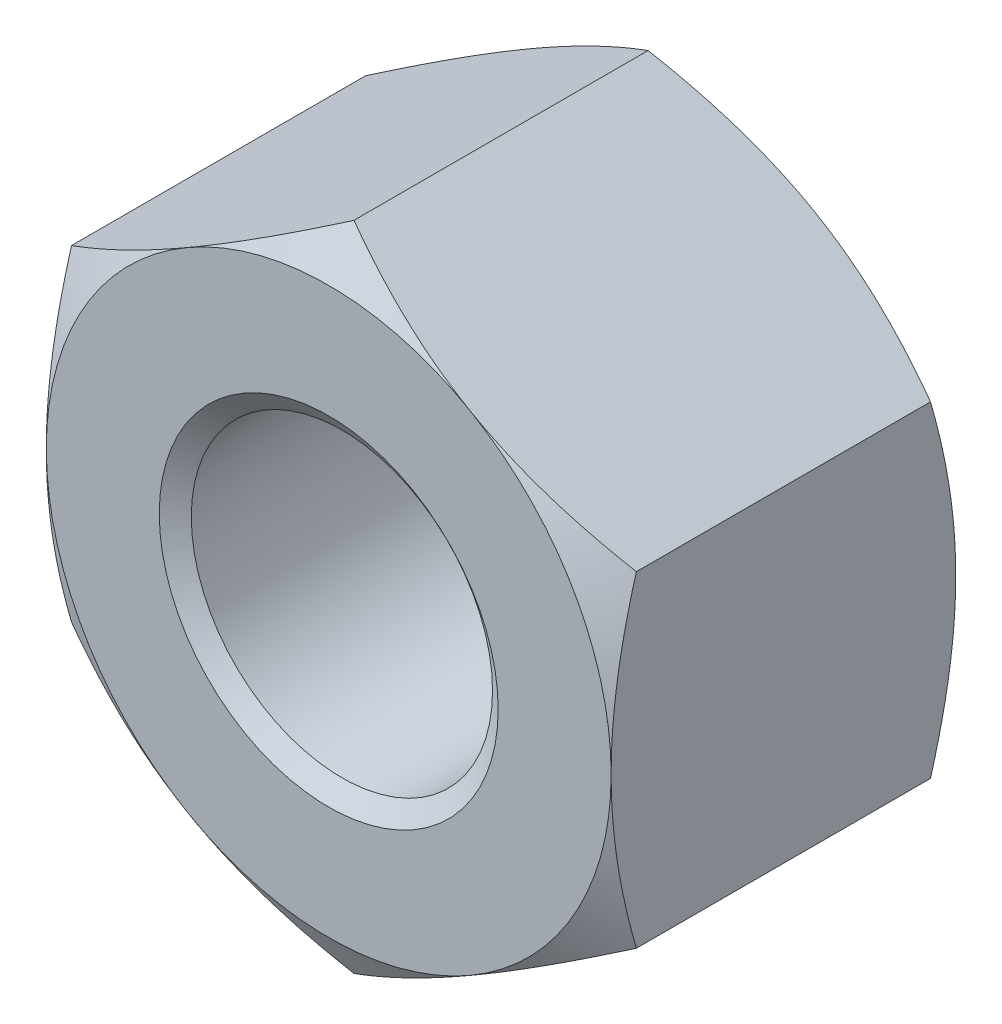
ISO-10303-21;
HEADER;
FILE_DESCRIPTION(('STEP AP214'),'2;1');
FILE_NAME('part.step','',(''),(''),'','','');
FILE_SCHEMA(('AUTOMOTIVE_DESIGN { 1 0 10303 214 1 1 1 1 }'));
ENDSEC;
DATA;
#1=APPLICATION_CONTEXT('core data for automotive mechanical design processes');
#2=APPLICATION_PROTOCOL_DEFINITION('international standard','automotive_design',2000,#1);
#3=PRODUCT_CONTEXT('',#1,'mechanical');
#4=PRODUCT('Part','Part','',(#3));
#5=PRODUCT_RELATED_PRODUCT_CATEGORY('part','',(#4));
#6=PRODUCT_DEFINITION_FORMATION('','',#4);
#7=PRODUCT_DEFINITION_CONTEXT('part definition',#1,'design');
#8=PRODUCT_DEFINITION('design','',#6,#7);
#9=PRODUCT_DEFINITION_SHAPE('','',#8);
#10=(LENGTH_UNIT() NAMED_UNIT(*) SI_UNIT(.MILLI.,.METRE.));
#11=(NAMED_UNIT(*) PLANE_ANGLE_UNIT() SI_UNIT($,.RADIAN.));
#12=(NAMED_UNIT(*) SI_UNIT($,.STERADIAN.) SOLID_ANGLE_UNIT());
#13=UNCERTAINTY_MEASURE_WITH_UNIT(LENGTH_MEASURE(1.E-05),#10,'distance_accuracy_value','');
#14=(GEOMETRIC_REPRESENTATION_CONTEXT(3) GLOBAL_UNCERTAINTY_ASSIGNED_CONTEXT((#13)) GLOBAL_UNIT_ASSIGNED_CONTEXT((#10,
#11,#12)) REPRESENTATION_CONTEXT('',''));
#15=CARTESIAN_POINT('',(0.,0.,0.));
#16=DIRECTION('',(0.,0.,1.));
#17=DIRECTION('',(1.,0.,0.));
#18=AXIS2_PLACEMENT_3D('',#15,#16,#17);
#19=CARTESIAN_POINT('',(0.,0.,-36.6));
#20=DIRECTION('',(0.,0.,1.));
#21=DIRECTION('',(1.,0.,0.));
#22=AXIS2_PLACEMENT_3D('',#19,#20,#21);
#23=CYLINDRICAL_SURFACE('',#22,16.);
#24=CARTESIAN_POINT('',(0.,0.,-1.40041507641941));
#25=DIRECTION('',(0.,0.,1.));
#26=DIRECTION('',(1.,0.,0.));
#27=AXIS2_PLACEMENT_3D('',#24,#25,#26);
#28=CIRCLE('',#27,16.);
#29=CARTESIAN_POINT('',(16.,0.,-1.40041507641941));
#30=VERTEX_POINT('',#29);
#31=EDGE_CURVE('E176',#30,#30,#28,.F.);
#32=ORIENTED_EDGE('',*,*,#31,.F.);
#33=EDGE_LOOP('',(#32));
#34=FACE_BOUND('',#33,.T.);
#35=CARTESIAN_POINT('',(0.,0.,-35.1741849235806));
#36=DIRECTION('',(0.,0.,-1.));
#37=DIRECTION('',(-1.,0.,0.));
#38=AXIS2_PLACEMENT_3D('',#35,#36,#37);
#39=CIRCLE('',#38,16.);
#40=CARTESIAN_POINT('',(-16.,0.,-35.1741849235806));
#41=VERTEX_POINT('',#40);
#42=EDGE_CURVE('E40',#41,#41,#39,.F.);
#43=ORIENTED_EDGE('',*,*,#42,.F.);
#44=EDGE_LOOP('',(#43));
#45=FACE_BOUND('',#44,.T.);
#46=ADVANCED_FACE('F35',(#34,#45),#23,.F.);
#47=CARTESIAN_POINT('',(0.,34.6410161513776,-36.6));
#48=DIRECTION('',(-0.500000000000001,0.866025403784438,0.));
#49=DIRECTION('',(-0.866025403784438,-0.500000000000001,0.));
#50=AXIS2_PLACEMENT_3D('',#47,#48,#49);
#51=PLANE('',#50);
#52=DIRECTION('',(0.,0.,1.));
#53=VECTOR('',#52,1.);
#54=CARTESIAN_POINT('',(-30.,17.3205080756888,-36.6));
#55=LINE('',#54,#53);
#56=CARTESIAN_POINT('',(-30.,17.3205080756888,-33.9205080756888));
#57=VERTEX_POINT('',#56);
#58=CARTESIAN_POINT('',(-30.,17.3205080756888,-2.67949192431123));
#59=VERTEX_POINT('',#58);
#60=EDGE_CURVE('E166',#57,#59,#55,.T.);
#61=ORIENTED_EDGE('',*,*,#60,.T.);
#62=CARTESIAN_POINT('',(-30.0002,17.3203926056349,-2.67955859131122));
#63=CARTESIAN_POINT('',(-29.3408134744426,17.7010895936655,-2.45977966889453));
#64=CARTESIAN_POINT('',(-28.6788549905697,18.0832715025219,-2.24997409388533));
#65=CARTESIAN_POINT('',(-27.349629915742,18.8506999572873,-1.85308185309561));
#66=CARTESIAN_POINT('',(-26.6823616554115,19.2359474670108,-1.66600265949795));
#67=CARTESIAN_POINT('',(-25.3412132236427,20.0102598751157,-1.31707423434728));
#68=CARTESIAN_POINT('',(-24.6673212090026,20.3993316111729,-1.15528525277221));
#69=CARTESIAN_POINT('',(-23.3148832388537,21.1801620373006,-0.860422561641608));
#70=CARTESIAN_POINT('',(-22.6363377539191,21.571920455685,-0.727345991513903));
#71=CARTESIAN_POINT('',(-21.2919369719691,22.3481106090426,-0.495557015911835));
#72=CARTESIAN_POINT('',(-20.6261813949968,22.7324847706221,-0.39607808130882));
#73=CARTESIAN_POINT('',(-19.2916197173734,23.5029943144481,-0.229274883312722));
#74=CARTESIAN_POINT('',(-18.6228135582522,23.8891297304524,-0.161951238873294));
#75=CARTESIAN_POINT('',(-17.2840778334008,24.6620491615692,-0.0611584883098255));
#76=CARTESIAN_POINT('',(-16.614150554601,25.0488318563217,-0.0276491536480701));
#77=CARTESIAN_POINT('',(-15.2736776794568,25.8227542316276,0.0047942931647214));
#78=CARTESIAN_POINT('',(-14.6031321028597,26.2098939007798,0.00372947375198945));
#79=CARTESIAN_POINT('',(-13.3495404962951,26.9336553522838,-0.0305600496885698));
#80=CARTESIAN_POINT('',(-12.766405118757,27.2703287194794,-0.0596034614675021));
#81=CARTESIAN_POINT('',(-11.6015250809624,27.9428725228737,-0.143287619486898));
#82=CARTESIAN_POINT('',(-11.0197804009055,28.2787429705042,-0.197927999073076));
#83=CARTESIAN_POINT('',(-9.85790357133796,28.9495528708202,-0.331855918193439));
#84=CARTESIAN_POINT('',(-9.27777336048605,29.2844912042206,-0.41116574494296));
#85=CARTESIAN_POINT('',(-8.12027041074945,29.9527758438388,-0.593040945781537));
#86=CARTESIAN_POINT('',(-7.54289766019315,30.2861221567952,-0.695606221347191));
#87=CARTESIAN_POINT('',(-6.37865168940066,30.9582998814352,-0.924874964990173));
#88=CARTESIAN_POINT('',(-5.79185010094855,31.2970899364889,-1.05206130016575));
#89=CARTESIAN_POINT('',(-4.6218384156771,31.9725964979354,-1.32717885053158));
#90=CARTESIAN_POINT('',(-4.03862881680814,32.3093127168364,-1.47511287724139));
#91=CARTESIAN_POINT('',(-2.87716867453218,32.9798820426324,-1.78948711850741));
#92=CARTESIAN_POINT('',(-2.29891074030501,33.3137394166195,-1.95589111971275));
#93=CARTESIAN_POINT('',(-1.14639443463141,33.9791450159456,-2.30554519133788));
#94=CARTESIAN_POINT('',(-0.572134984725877,34.3106938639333,-2.48879051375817));
#95=CARTESIAN_POINT('',(0.00020000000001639,34.6411316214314,-2.67955859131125));
#96=B_SPLINE_CURVE_WITH_KNOTS('',3,(#62,#63,#64,#65,#66,#67,#68,#69,#70,#71,#72,#73,#74,#75,#76,
#77,#78,#79,#80,#81,#82,#83,#84,#85,#86,#87,#88,#89,#90,#91,#92,#93,#94,#95),.UNSPECIFIED.,.F.,
.F.,(4,2,2,2,2,2,2,2,2,2,2,2,2,2,2,2,4),(0.,2.37750032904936,4.75578025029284,7.13964242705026,
9.52326699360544,11.8481083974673,14.172994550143,16.4951115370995,18.8171567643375,
20.8385880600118,22.8599904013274,24.8832242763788,26.9064495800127,28.9743372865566,
31.042505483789,33.1066880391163,35.1702904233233),.UNSPECIFIED.);
#97=CARTESIAN_POINT('',(-15.,25.9807621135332,0.));
#98=VERTEX_POINT('',#97);
#99=EDGE_CURVE('E62',#59,#98,#96,.T.);
#100=ORIENTED_EDGE('',*,*,#99,.T.);
#101=CARTESIAN_POINT('',(0.,34.6410161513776,-2.67949192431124));
#102=VERTEX_POINT('',#101);
#103=EDGE_CURVE('E245',#98,#102,#96,.T.);
#104=ORIENTED_EDGE('',*,*,#103,.T.);
#105=DIRECTION('',(0.,0.,1.));
#106=VECTOR('',#105,1.);
#107=CARTESIAN_POINT('',(0.,34.6410161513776,-36.6));
#108=LINE('',#107,#106);
#109=CARTESIAN_POINT('',(0.,34.6410161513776,-33.9205080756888));
#110=VERTEX_POINT('',#109);
#111=EDGE_CURVE('E151',#110,#102,#108,.T.);
#112=ORIENTED_EDGE('',*,*,#111,.F.);
#113=CARTESIAN_POINT('',(-30.0002,17.3203926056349,-33.9204414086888));
#114=CARTESIAN_POINT('',(-29.3408134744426,17.7010895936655,-34.1402203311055));
#115=CARTESIAN_POINT('',(-28.6788549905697,18.0832715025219,-34.3500259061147));
#116=CARTESIAN_POINT('',(-27.349629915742,18.8506999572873,-34.7469181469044));
#117=CARTESIAN_POINT('',(-26.6823616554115,19.2359474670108,-34.9339973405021));
#118=CARTESIAN_POINT('',(-25.3412132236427,20.0102598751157,-35.2829257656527));
#119=CARTESIAN_POINT('',(-24.6673212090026,20.3993316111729,-35.4447147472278));
#120=CARTESIAN_POINT('',(-23.3148832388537,21.1801620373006,-35.7395774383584));
#121=CARTESIAN_POINT('',(-22.6363377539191,21.571920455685,-35.8726540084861));
#122=CARTESIAN_POINT('',(-21.2919369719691,22.3481106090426,-36.1044429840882));
#123=CARTESIAN_POINT('',(-20.6261813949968,22.7324847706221,-36.2039219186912));
#124=CARTESIAN_POINT('',(-19.2916197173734,23.5029943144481,-36.3707251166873));
#125=CARTESIAN_POINT('',(-18.6228135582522,23.8891297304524,-36.4380487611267));
#126=CARTESIAN_POINT('',(-17.2840778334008,24.6620491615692,-36.5388415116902));
#127=CARTESIAN_POINT('',(-16.614150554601,25.0488318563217,-36.5723508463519));
#128=CARTESIAN_POINT('',(-15.2736776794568,25.8227542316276,-36.6047942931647));
#129=CARTESIAN_POINT('',(-14.6031321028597,26.2098939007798,-36.603729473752));
#130=CARTESIAN_POINT('',(-13.3495404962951,26.9336553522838,-36.5694399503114));
#131=CARTESIAN_POINT('',(-12.766405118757,27.2703287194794,-36.5403965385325));
#132=CARTESIAN_POINT('',(-11.6015250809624,27.9428725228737,-36.4567123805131));
#133=CARTESIAN_POINT('',(-11.0197804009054,28.2787429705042,-36.4020720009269));
#134=CARTESIAN_POINT('',(-9.85790357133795,28.9495528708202,-36.2681440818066));
#135=CARTESIAN_POINT('',(-9.27777336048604,29.2844912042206,-36.188834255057));
#136=CARTESIAN_POINT('',(-8.12027041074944,29.9527758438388,-36.0069590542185));
#137=CARTESIAN_POINT('',(-7.54289766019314,30.2861221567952,-35.9043937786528));
#138=CARTESIAN_POINT('',(-6.37865168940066,30.9582998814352,-35.6751250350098));
#139=CARTESIAN_POINT('',(-5.79185010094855,31.2970899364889,-35.5479386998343));
#140=CARTESIAN_POINT('',(-4.6218384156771,31.9725964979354,-35.2728211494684));
#141=CARTESIAN_POINT('',(-4.03862881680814,32.3093127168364,-35.1248871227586));
#142=CARTESIAN_POINT('',(-2.87716867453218,32.9798820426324,-34.8105128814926));
#143=CARTESIAN_POINT('',(-2.29891074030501,33.3137394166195,-34.6441088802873));
#144=CARTESIAN_POINT('',(-1.14639443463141,33.9791450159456,-34.2944548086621));
#145=CARTESIAN_POINT('',(-0.572134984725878,34.3106938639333,-34.1112094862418));
#146=CARTESIAN_POINT('',(0.000200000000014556,34.6411316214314,-33.9204414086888));
#147=B_SPLINE_CURVE_WITH_KNOTS('',3,(#113,#114,#115,#116,#117,#118,#119,#120,#121,#122,#123,
#124,#125,#126,#127,#128,#129,#130,#131,#132,#133,#134,#135,#136,#137,#138,#139,#140,#141,#142,
#143,#144,#145,#146),.UNSPECIFIED.,.F.,.F.,(4,2,2,2,2,2,2,2,2,2,2,2,2,2,2,2,4),(0.,
2.37750032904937,4.75578025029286,7.13964242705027,9.52326699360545,11.8481083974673,
14.172994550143,16.4951115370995,18.8171567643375,20.8385880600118,22.8599904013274,
24.8832242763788,26.9064495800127,28.9743372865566,31.042505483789,33.1066880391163,
35.1702904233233),.UNSPECIFIED.);
#148=CARTESIAN_POINT('',(-15.,25.9807621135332,-36.6));
#149=VERTEX_POINT('',#148);
#150=EDGE_CURVE('E169',#149,#110,#147,.T.);
#151=ORIENTED_EDGE('',*,*,#150,.F.);
#152=EDGE_CURVE('E268',#57,#149,#147,.T.);
#153=ORIENTED_EDGE('',*,*,#152,.F.);
#154=EDGE_LOOP('',(#61,#100,#104,#112,#151,#153));
#155=FACE_BOUND('',#154,.T.);
#156=ADVANCED_FACE('F37',(#155),#51,.T.);
#157=CARTESIAN_POINT('',(30.,17.3205080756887,-36.6));
#158=DIRECTION('',(0.500000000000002,0.866025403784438,0.));
#159=DIRECTION('',(-0.866025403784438,0.500000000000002,0.));
#160=AXIS2_PLACEMENT_3D('',#157,#158,#159);
#161=PLANE('',#160);
#162=ORIENTED_EDGE('',*,*,#111,.T.);
#163=CARTESIAN_POINT('',(-0.000199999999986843,34.6411316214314,-2.67955859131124));
#164=CARTESIAN_POINT('',(0.659186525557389,34.2604346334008,-2.45977966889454));
#165=CARTESIAN_POINT('',(1.32114500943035,33.8782527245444,-2.24997409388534));
#166=CARTESIAN_POINT('',(2.65037008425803,33.1108242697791,-1.85308185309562));
#167=CARTESIAN_POINT('',(3.3176383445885,32.7255767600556,-1.66600265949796));
#168=CARTESIAN_POINT('',(4.65878677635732,31.9512643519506,-1.31707423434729));
#169=CARTESIAN_POINT('',(5.33267879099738,31.5621926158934,-1.15528525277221));
#170=CARTESIAN_POINT('',(6.68511676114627,30.7813621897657,-0.860422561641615));
#171=CARTESIAN_POINT('',(7.36366224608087,30.3896037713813,-0.727345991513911));
#172=CARTESIAN_POINT('',(8.70806302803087,29.6134136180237,-0.495557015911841));
#173=CARTESIAN_POINT('',(9.37381860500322,29.2290394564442,-0.396078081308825));
#174=CARTESIAN_POINT('',(10.7083802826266,28.4585299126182,-0.229274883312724));
#175=CARTESIAN_POINT('',(11.3771864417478,28.0723944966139,-0.161951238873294));
#176=CARTESIAN_POINT('',(12.7159221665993,27.2994750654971,-0.0611584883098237));
#177=CARTESIAN_POINT('',(13.385849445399,26.9126923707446,-0.0276491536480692));
#178=CARTESIAN_POINT('',(14.7263223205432,26.1387699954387,0.00479429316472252));
#179=CARTESIAN_POINT('',(15.3968678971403,25.7516303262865,0.0037294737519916));
#180=CARTESIAN_POINT('',(16.6504595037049,25.0278688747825,-0.030560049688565));
#181=CARTESIAN_POINT('',(17.233594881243,24.6911955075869,-0.0596034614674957));
#182=CARTESIAN_POINT('',(18.3984749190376,24.0186517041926,-0.14328761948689));
#183=CARTESIAN_POINT('',(18.9802195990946,23.6827812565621,-0.197927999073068));
#184=CARTESIAN_POINT('',(20.1420964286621,23.0119713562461,-0.33185591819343));
#185=CARTESIAN_POINT('',(20.722226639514,22.6770330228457,-0.411165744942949));
#186=CARTESIAN_POINT('',(21.8797295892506,22.0087483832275,-0.593040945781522));
#187=CARTESIAN_POINT('',(22.4571023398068,21.6754020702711,-0.695606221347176));
#188=CARTESIAN_POINT('',(23.6213483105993,21.0032243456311,-0.924874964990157));
#189=CARTESIAN_POINT('',(24.2081498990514,20.6644342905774,-1.05206130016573));
#190=CARTESIAN_POINT('',(25.3781615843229,19.9889277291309,-1.32717885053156));
#191=CARTESIAN_POINT('',(25.9613711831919,19.6522115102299,-1.47511287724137));
#192=CARTESIAN_POINT('',(27.1228313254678,18.9816421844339,-1.78948711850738));
#193=CARTESIAN_POINT('',(27.701089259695,18.6477848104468,-1.95589111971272));
#194=CARTESIAN_POINT('',(28.8536055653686,17.9823792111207,-2.30554519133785));
#195=CARTESIAN_POINT('',(29.4278650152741,17.650830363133,-2.48879051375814));
#196=CARTESIAN_POINT('',(30.0002,17.3203926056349,-2.67955859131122));
#197=B_SPLINE_CURVE_WITH_KNOTS('',3,(#163,#164,#165,#166,#167,#168,#169,#170,#171,#172,#173,
#174,#175,#176,#177,#178,#179,#180,#181,#182,#183,#184,#185,#186,#187,#188,#189,#190,#191,#192,
#193,#194,#195,#196),.UNSPECIFIED.,.F.,.F.,(4,2,2,2,2,2,2,2,2,2,2,2,2,2,2,2,4),(0.,
2.37750032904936,4.75578025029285,7.13964242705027,9.52326699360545,11.8481083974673,
14.172994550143,16.4951115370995,18.8171567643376,20.8385880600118,22.8599904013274,
24.8832242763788,26.9064495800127,28.9743372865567,31.042505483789,33.1066880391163,
35.1702904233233),.UNSPECIFIED.);
#198=CARTESIAN_POINT('',(15.,25.9807621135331,0.));
#199=VERTEX_POINT('',#198);
#200=EDGE_CURVE('E144',#102,#199,#197,.T.);
#201=ORIENTED_EDGE('',*,*,#200,.T.);
#202=CARTESIAN_POINT('',(30.,17.3205080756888,-2.67949192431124));
#203=VERTEX_POINT('',#202);
#204=EDGE_CURVE('E130',#199,#203,#197,.T.);
#205=ORIENTED_EDGE('',*,*,#204,.T.);
#206=DIRECTION('',(0.,0.,1.));
#207=VECTOR('',#206,1.);
#208=CARTESIAN_POINT('',(30.,17.3205080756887,-36.6));
#209=LINE('',#208,#207);
#210=CARTESIAN_POINT('',(30.,17.3205080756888,-33.9205080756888));
#211=VERTEX_POINT('',#210);
#212=EDGE_CURVE('E143',#211,#203,#209,.T.);
#213=ORIENTED_EDGE('',*,*,#212,.F.);
#214=CARTESIAN_POINT('',(-0.000199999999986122,34.6411316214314,-33.9204414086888));
#215=CARTESIAN_POINT('',(0.659186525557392,34.2604346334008,-34.1402203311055));
#216=CARTESIAN_POINT('',(1.32114500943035,33.8782527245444,-34.3500259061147));
#217=CARTESIAN_POINT('',(2.65037008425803,33.1108242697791,-34.7469181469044));
#218=CARTESIAN_POINT('',(3.31763834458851,32.7255767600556,-34.933997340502));
#219=CARTESIAN_POINT('',(4.65878677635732,31.9512643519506,-35.2829257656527));
#220=CARTESIAN_POINT('',(5.33267879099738,31.5621926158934,-35.4447147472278));
#221=CARTESIAN_POINT('',(6.68511676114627,30.7813621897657,-35.7395774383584));
#222=CARTESIAN_POINT('',(7.36366224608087,30.3896037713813,-35.8726540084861));
#223=CARTESIAN_POINT('',(8.70806302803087,29.6134136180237,-36.1044429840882));
#224=CARTESIAN_POINT('',(9.37381860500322,29.2290394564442,-36.2039219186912));
#225=CARTESIAN_POINT('',(10.7083802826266,28.4585299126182,-36.3707251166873));
#226=CARTESIAN_POINT('',(11.3771864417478,28.0723944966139,-36.4380487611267));
#227=CARTESIAN_POINT('',(12.7159221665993,27.2994750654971,-36.5388415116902));
#228=CARTESIAN_POINT('',(13.385849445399,26.9126923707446,-36.5723508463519));
#229=CARTESIAN_POINT('',(14.7263223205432,26.1387699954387,-36.6047942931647));
#230=CARTESIAN_POINT('',(15.3968678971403,25.7516303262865,-36.603729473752));
#231=CARTESIAN_POINT('',(16.6504595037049,25.0278688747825,-36.5694399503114));
#232=CARTESIAN_POINT('',(17.233594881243,24.6911955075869,-36.5403965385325));
#233=CARTESIAN_POINT('',(18.3984749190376,24.0186517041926,-36.4567123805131));
#234=CARTESIAN_POINT('',(18.9802195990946,23.6827812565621,-36.4020720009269));
#235=CARTESIAN_POINT('',(20.142096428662,23.0119713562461,-36.2681440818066));
#236=CARTESIAN_POINT('',(20.722226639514,22.6770330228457,-36.188834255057));
#237=CARTESIAN_POINT('',(21.8797295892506,22.0087483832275,-36.0069590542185));
#238=CARTESIAN_POINT('',(22.4571023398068,21.6754020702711,-35.9043937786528));
#239=CARTESIAN_POINT('',(23.6213483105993,21.0032243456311,-35.6751250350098));
#240=CARTESIAN_POINT('',(24.2081498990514,20.6644342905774,-35.5479386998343));
#241=CARTESIAN_POINT('',(25.3781615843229,19.9889277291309,-35.2728211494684));
#242=CARTESIAN_POINT('',(25.9613711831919,19.6522115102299,-35.1248871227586));
#243=CARTESIAN_POINT('',(27.1228313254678,18.9816421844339,-34.8105128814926));
#244=CARTESIAN_POINT('',(27.701089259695,18.6477848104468,-34.6441088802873));
#245=CARTESIAN_POINT('',(28.8536055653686,17.9823792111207,-34.2944548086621));
#246=CARTESIAN_POINT('',(29.4278650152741,17.650830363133,-34.1112094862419));
#247=CARTESIAN_POINT('',(30.0002,17.3203926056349,-33.9204414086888));
#248=B_SPLINE_CURVE_WITH_KNOTS('',3,(#214,#215,#216,#217,#218,#219,#220,#221,#222,#223,#224,
#225,#226,#227,#228,#229,#230,#231,#232,#233,#234,#235,#236,#237,#238,#239,#240,#241,#242,#243,
#244,#245,#246,#247),.UNSPECIFIED.,.F.,.F.,(4,2,2,2,2,2,2,2,2,2,2,2,2,2,2,2,4),(0.,
2.37750032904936,4.75578025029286,7.13964242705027,9.52326699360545,11.8481083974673,
14.172994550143,16.4951115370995,18.8171567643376,20.8385880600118,22.8599904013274,
24.8832242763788,26.9064495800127,28.9743372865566,31.042505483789,33.1066880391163,
35.1702904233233),.UNSPECIFIED.);
#249=CARTESIAN_POINT('',(15.,25.9807621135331,-36.6));
#250=VERTEX_POINT('',#249);
#251=EDGE_CURVE('E261',#250,#211,#248,.T.);
#252=ORIENTED_EDGE('',*,*,#251,.F.);
#253=EDGE_CURVE('E267',#110,#250,#248,.T.);
#254=ORIENTED_EDGE('',*,*,#253,.F.);
#255=EDGE_LOOP('',(#162,#201,#205,#213,#252,#254));
#256=FACE_BOUND('',#255,.T.);
#257=ADVANCED_FACE('F141',(#256),#161,.T.);
#258=CARTESIAN_POINT('',(30.,17.3205080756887,-36.6));
#259=DIRECTION('',(-1.,0.,0.));
#260=DIRECTION('',(0.,0.,1.));
#261=AXIS2_PLACEMENT_3D('',#258,#259,#260);
#262=PLANE('',#261);
#263=CARTESIAN_POINT('',(30.,-45.9365399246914,-14.3558011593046));
#264=CARTESIAN_POINT('',(30.,-45.2779799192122,-14.0374660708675));
#265=CARTESIAN_POINT('',(30.,-44.618623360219,-13.7207736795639));
#266=CARTESIAN_POINT('',(30.,-43.2981500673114,-13.0910621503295));
#267=CARTESIAN_POINT('',(30.,-42.6370333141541,-12.77804305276));
#268=CARTESIAN_POINT('',(30.,-41.3127746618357,-12.156020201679));
#269=CARTESIAN_POINT('',(30.,-40.6496324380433,-11.8470171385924));
#270=CARTESIAN_POINT('',(30.,-39.3212556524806,-11.2335482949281));
#271=CARTESIAN_POINT('',(30.,-38.6560210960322,-10.9290825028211));
#272=CARTESIAN_POINT('',(30.,-36.6492550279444,-10.0197947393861));
#273=CARTESIAN_POINT('',(30.,-35.3042292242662,-9.42265106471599));
#274=CARTESIAN_POINT('',(30.,-32.6031179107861,-8.25397733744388));
#275=CARTESIAN_POINT('',(30.,-31.2470329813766,-7.68244595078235));
#276=CARTESIAN_POINT('',(30.,-29.1945715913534,-6.84617094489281));
#277=CARTESIAN_POINT('',(30.,-28.5031277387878,-6.56930860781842));
#278=CARTESIAN_POINT('',(30.,-27.1165240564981,-6.02506333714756));
#279=CARTESIAN_POINT('',(30.,-26.4213642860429,-5.75768025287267));
#280=CARTESIAN_POINT('',(30.,-25.0269061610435,-5.23361865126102));
#281=CARTESIAN_POINT('',(30.,-24.327607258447,-4.97694158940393));
#282=CARTESIAN_POINT('',(30.,-22.9246473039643,-4.47578921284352));
#283=CARTESIAN_POINT('',(30.,-22.2209862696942,-4.23131384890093));
#284=CARTESIAN_POINT('',(30.,-20.8104996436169,-3.75672417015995));
#285=CARTESIAN_POINT('',(30.,-20.1036841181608,-3.52658008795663));
#286=CARTESIAN_POINT('',(30.,-18.6851603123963,-3.08194699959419));
#287=CARTESIAN_POINT('',(30.,-17.9734519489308,-2.86745826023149));
#288=CARTESIAN_POINT('',(30.,-15.8309943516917,-2.25062130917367));
#289=CARTESIAN_POINT('',(30.,-14.3923690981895,-1.87471629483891));
#290=CARTESIAN_POINT('',(30.,-12.2190084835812,-1.37763749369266));
#291=CARTESIAN_POINT('',(30.,-11.4918302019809,-1.22304890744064));
#292=CARTESIAN_POINT('',(30.,-10.032627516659,-0.938571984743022));
#293=CARTESIAN_POINT('',(30.,-9.30060322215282,-0.808683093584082));
#294=CARTESIAN_POINT('',(30.,-7.83220784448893,-0.575908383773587));
#295=CARTESIAN_POINT('',(30.,-7.09583649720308,-0.47302422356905));
#296=CARTESIAN_POINT('',(30.,-5.61958846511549,-0.296325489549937));
#297=CARTESIAN_POINT('',(30.,-4.87971177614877,-0.222510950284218));
#298=CARTESIAN_POINT('',(30.,-3.40223019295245,-0.105938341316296));
#299=CARTESIAN_POINT('',(30.,-2.66464072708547,-0.0629859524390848));
#300=CARTESIAN_POINT('',(30.,-1.18830595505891,-0.00836455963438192));
#301=CARTESIAN_POINT('',(30.,-0.449560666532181,0.00330491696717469));
#302=CARTESIAN_POINT('',(30.,1.02754564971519,-0.0049121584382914));
#303=CARTESIAN_POINT('',(30.,1.76590672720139,-0.0247899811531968));
#304=CARTESIAN_POINT('',(30.,3.24116955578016,-0.0956227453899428));
#305=CARTESIAN_POINT('',(30.,3.97807124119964,-0.14657905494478));
#306=CARTESIAN_POINT('',(30.,5.23855697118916,-0.259530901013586));
#307=CARTESIAN_POINT('',(30.,5.76281317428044,-0.314189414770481));
#308=CARTESIAN_POINT('',(30.,6.8095998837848,-0.438134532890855));
#309=CARTESIAN_POINT('',(30.,7.33213033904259,-0.50742156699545));
#310=CARTESIAN_POINT('',(30.,8.89675150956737,-0.736205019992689));
#311=CARTESIAN_POINT('',(30.,9.93583394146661,-0.916620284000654));
#312=CARTESIAN_POINT('',(30.,12.0063032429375,-1.32712724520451));
#313=CARTESIAN_POINT('',(30.,13.0376686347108,-1.55732543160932));
#314=CARTESIAN_POINT('',(30.,15.0898614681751,-2.06024329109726));
#315=CARTESIAN_POINT('',(30.,16.1106893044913,-2.33296136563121));
#316=CARTESIAN_POINT('',(30.,18.1658167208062,-2.92121193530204));
#317=CARTESIAN_POINT('',(30.,19.1998696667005,-3.2375994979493));
#318=CARTESIAN_POINT('',(30.,21.2578611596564,-3.9018741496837));
#319=CARTESIAN_POINT('',(30.,22.2817987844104,-4.24976408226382));
#320=CARTESIAN_POINT('',(30.,23.8078178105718,-4.79021589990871));
#321=CARTESIAN_POINT('',(30.,24.3134225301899,-4.97292492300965));
#322=CARTESIAN_POINT('',(30.,25.3224597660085,-5.34426474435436));
#323=CARTESIAN_POINT('',(30.,25.8258922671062,-5.53289558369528));
#324=CARTESIAN_POINT('',(30.,26.8305266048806,-5.9154885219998));
#325=CARTESIAN_POINT('',(30.,27.3317291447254,-6.10944877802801));
#326=CARTESIAN_POINT('',(30.,28.3321829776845,-6.50229905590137));
#327=CARTESIAN_POINT('',(30.,28.8314343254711,-6.70118893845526));
#328=CARTESIAN_POINT('',(30.,29.3297774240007,-6.9023175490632));
#329=B_SPLINE_CURVE_WITH_KNOTS('',3,(#263,#264,#265,#266,#267,#268,#269,#270,#271,#272,#273,
#274,#275,#276,#277,#278,#279,#280,#281,#282,#283,#284,#285,#286,#287,#288,#289,#290,#291,#292,
#293,#294,#295,#296,#297,#298,#299,#300,#301,#302,#303,#304,#305,#306,#307,#308,#309,#310,#311,
#312,#313,#314,#315,#316,#317,#318,#319,#320,#321,#322,#323,#324,#325,#326,#327,#328),
.UNSPECIFIED.,.F.,.F.,(4,2,2,2,2,2,2,2,2,2,2,2,2,2,2,2,2,2,2,2,2,2,2,2,2,2,2,2,2,2,2,2,4),(0.,
2.19439073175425,4.38880555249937,6.58359276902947,8.77837440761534,13.1930371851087,
17.6074697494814,19.841854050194,22.0762028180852,24.3108543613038,26.5454968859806,
28.7753313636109,31.0052038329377,35.463226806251,37.6931748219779,39.9230727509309,
42.1531075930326,44.3831450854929,46.5990153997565,48.8148522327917,51.0300760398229,
53.2453973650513,54.826487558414,56.4076242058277,59.5700120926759,62.7392326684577,
65.9083341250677,69.1518605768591,72.3956800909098,74.0084654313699,75.6212619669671,
77.2335076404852,78.8457078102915),.UNSPECIFIED.);
#330=CARTESIAN_POINT('',(30.,-17.3205080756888,-2.67949192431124));
#331=VERTEX_POINT('',#330);
#332=CARTESIAN_POINT('',(30.,0.,0.));
#333=VERTEX_POINT('',#332);
#334=EDGE_CURVE('E136',#331,#333,#329,.T.);
#335=ORIENTED_EDGE('',*,*,#334,.F.);
#336=DIRECTION('',(0.,0.,1.));
#337=VECTOR('',#336,1.);
#338=CARTESIAN_POINT('',(30.,-17.3205080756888,-36.6));
#339=LINE('',#338,#337);
#340=CARTESIAN_POINT('',(30.,-17.3205080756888,-33.9205080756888));
#341=VERTEX_POINT('',#340);
#342=EDGE_CURVE('E152',#341,#331,#339,.T.);
#343=ORIENTED_EDGE('',*,*,#342,.F.);
#344=CARTESIAN_POINT('',(30.,-45.9365399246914,-22.2441988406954));
#345=CARTESIAN_POINT('',(30.,-45.2779799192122,-22.5625339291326));
#346=CARTESIAN_POINT('',(30.,-44.618623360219,-22.8792263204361));
#347=CARTESIAN_POINT('',(30.,-43.2981500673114,-23.5089378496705));
#348=CARTESIAN_POINT('',(30.,-42.6370333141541,-23.82195694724));
#349=CARTESIAN_POINT('',(30.,-41.3127746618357,-24.443979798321));
#350=CARTESIAN_POINT('',(30.,-40.6496324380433,-24.7529828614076));
#351=CARTESIAN_POINT('',(30.,-39.3212556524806,-25.3664517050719));
#352=CARTESIAN_POINT('',(30.,-38.6560210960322,-25.6709174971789));
#353=CARTESIAN_POINT('',(30.,-36.6492550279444,-26.5802052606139));
#354=CARTESIAN_POINT('',(30.,-35.3042292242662,-27.177348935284));
#355=CARTESIAN_POINT('',(30.,-32.6031179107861,-28.3460226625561));
#356=CARTESIAN_POINT('',(30.,-31.2470329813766,-28.9175540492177));
#357=CARTESIAN_POINT('',(30.,-29.1945715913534,-29.7538290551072));
#358=CARTESIAN_POINT('',(30.,-28.5031277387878,-30.0306913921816));
#359=CARTESIAN_POINT('',(30.,-27.116524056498,-30.5749366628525));
#360=CARTESIAN_POINT('',(30.,-26.4213642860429,-30.8423197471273));
#361=CARTESIAN_POINT('',(30.,-25.0269061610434,-31.366381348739));
#362=CARTESIAN_POINT('',(30.,-24.327607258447,-31.6230584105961));
#363=CARTESIAN_POINT('',(30.,-22.9246473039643,-32.1242107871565));
#364=CARTESIAN_POINT('',(30.,-22.2209862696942,-32.3686861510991));
#365=CARTESIAN_POINT('',(30.,-20.8104996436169,-32.8432758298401));
#366=CARTESIAN_POINT('',(30.,-20.1036841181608,-33.0734199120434));
#367=CARTESIAN_POINT('',(30.,-18.6851603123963,-33.5180530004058));
#368=CARTESIAN_POINT('',(30.,-17.9734519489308,-33.7325417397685));
#369=CARTESIAN_POINT('',(30.,-15.8309943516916,-34.3493786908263));
#370=CARTESIAN_POINT('',(30.,-14.3923690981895,-34.7252837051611));
#371=CARTESIAN_POINT('',(30.,-12.2190084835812,-35.2223625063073));
#372=CARTESIAN_POINT('',(30.,-11.4918302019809,-35.3769510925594));
#373=CARTESIAN_POINT('',(30.,-10.032627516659,-35.661428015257));
#374=CARTESIAN_POINT('',(30.,-9.30060322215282,-35.7913169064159));
#375=CARTESIAN_POINT('',(30.,-7.83220784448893,-36.0240916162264));
#376=CARTESIAN_POINT('',(30.,-7.09583649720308,-36.1269757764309));
#377=CARTESIAN_POINT('',(30.,-5.6195884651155,-36.3036745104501));
#378=CARTESIAN_POINT('',(30.,-4.87971177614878,-36.3774890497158));
#379=CARTESIAN_POINT('',(30.,-3.40223019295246,-36.4940616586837));
#380=CARTESIAN_POINT('',(30.,-2.66464072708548,-36.5370140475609));
#381=CARTESIAN_POINT('',(30.,-1.18830595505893,-36.5916354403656));
#382=CARTESIAN_POINT('',(30.,-0.449560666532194,-36.6033049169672));
#383=CARTESIAN_POINT('',(30.,1.02754564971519,-36.5950878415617));
#384=CARTESIAN_POINT('',(30.,1.76590672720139,-36.5752100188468));
#385=CARTESIAN_POINT('',(30.,3.24116955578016,-36.5043772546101));
#386=CARTESIAN_POINT('',(30.,3.97807124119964,-36.4534209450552));
#387=CARTESIAN_POINT('',(30.,5.23855697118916,-36.3404690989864));
#388=CARTESIAN_POINT('',(30.,5.76281317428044,-36.2858105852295));
#389=CARTESIAN_POINT('',(30.,6.8095998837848,-36.1618654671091));
#390=CARTESIAN_POINT('',(30.,7.33213033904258,-36.0925784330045));
#391=CARTESIAN_POINT('',(30.,8.89675150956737,-35.8637949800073));
#392=CARTESIAN_POINT('',(30.,9.93583394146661,-35.6833797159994));
#393=CARTESIAN_POINT('',(30.,12.0063032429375,-35.2728727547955));
#394=CARTESIAN_POINT('',(30.,13.0376686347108,-35.0426745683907));
#395=CARTESIAN_POINT('',(30.,15.0898614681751,-34.5397567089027));
#396=CARTESIAN_POINT('',(30.,16.1106893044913,-34.2670386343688));
#397=CARTESIAN_POINT('',(30.,18.1658167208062,-33.678788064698));
#398=CARTESIAN_POINT('',(30.,19.1998696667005,-33.3624005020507));
#399=CARTESIAN_POINT('',(30.,21.2578611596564,-32.6981258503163));
#400=CARTESIAN_POINT('',(30.,22.2817987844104,-32.3502359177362));
#401=CARTESIAN_POINT('',(30.,23.8078178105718,-31.8097841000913));
#402=CARTESIAN_POINT('',(30.,24.3134225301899,-31.6270750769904));
#403=CARTESIAN_POINT('',(30.,25.3224597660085,-31.2557352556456));
#404=CARTESIAN_POINT('',(30.,25.8258922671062,-31.0671044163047));
#405=CARTESIAN_POINT('',(30.,26.8305266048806,-30.6845114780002));
#406=CARTESIAN_POINT('',(30.,27.3317291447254,-30.490551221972));
#407=CARTESIAN_POINT('',(30.,28.3321829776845,-30.0977009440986));
#408=CARTESIAN_POINT('',(30.,28.8314343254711,-29.8988110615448));
#409=CARTESIAN_POINT('',(30.,29.3297774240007,-29.6976824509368));
#410=B_SPLINE_CURVE_WITH_KNOTS('',3,(#344,#345,#346,#347,#348,#349,#350,#351,#352,#353,#354,
#355,#356,#357,#358,#359,#360,#361,#362,#363,#364,#365,#366,#367,#368,#369,#370,#371,#372,#373,
#374,#375,#376,#377,#378,#379,#380,#381,#382,#383,#384,#385,#386,#387,#388,#389,#390,#391,#392,
#393,#394,#395,#396,#397,#398,#399,#400,#401,#402,#403,#404,#405,#406,#407,#408,#409),
.UNSPECIFIED.,.F.,.F.,(4,2,2,2,2,2,2,2,2,2,2,2,2,2,2,2,2,2,2,2,2,2,2,2,2,2,2,2,2,2,2,2,4),(0.,
2.19439073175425,4.38880555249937,6.58359276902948,8.77837440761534,13.1930371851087,
17.6074697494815,19.8418540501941,22.0762028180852,24.3108543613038,26.5454968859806,
28.7753313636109,31.0052038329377,35.463226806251,37.6931748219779,39.9230727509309,
42.1531075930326,44.3831450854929,46.5990153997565,48.8148522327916,51.0300760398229,
53.2453973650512,54.826487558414,56.4076242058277,59.5700120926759,62.7392326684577,
65.9083341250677,69.1518605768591,72.3956800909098,74.0084654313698,75.621261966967,
77.2335076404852,78.8457078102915),.UNSPECIFIED.);
#411=CARTESIAN_POINT('',(30.,0.,-36.6));
#412=VERTEX_POINT('',#411);
#413=EDGE_CURVE('E274',#341,#412,#410,.T.);
#414=ORIENTED_EDGE('',*,*,#413,.T.);
#415=EDGE_CURVE('E150',#412,#211,#410,.T.);
#416=ORIENTED_EDGE('',*,*,#415,.T.);
#417=ORIENTED_EDGE('',*,*,#212,.T.);
#418=EDGE_CURVE('E127',#333,#203,#329,.T.);
#419=ORIENTED_EDGE('',*,*,#418,.F.);
#420=EDGE_LOOP('',(#335,#343,#414,#416,#417,#419));
#421=FACE_BOUND('',#420,.T.);
#422=ADVANCED_FACE('F147',(#421),#262,.F.);
#423=CARTESIAN_POINT('',(0.,-34.6410161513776,-36.6));
#424=DIRECTION('',(0.500000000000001,-0.866025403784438,0.));
#425=DIRECTION('',(0.866025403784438,0.500000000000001,0.));
#426=AXIS2_PLACEMENT_3D('',#423,#424,#425);
#427=PLANE('',#426);
#428=ORIENTED_EDGE('',*,*,#342,.T.);
#429=CARTESIAN_POINT('',(30.0002,-17.320392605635,-2.67955859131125));
#430=CARTESIAN_POINT('',(29.3408134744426,-17.7010895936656,-2.45977966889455));
#431=CARTESIAN_POINT('',(28.6788549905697,-18.083271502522,-2.24997409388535));
#432=CARTESIAN_POINT('',(27.349629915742,-18.8506999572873,-1.85308185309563));
#433=CARTESIAN_POINT('',(26.6823616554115,-19.2359474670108,-1.66600265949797));
#434=CARTESIAN_POINT('',(25.3412132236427,-20.0102598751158,-1.31707423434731));
#435=CARTESIAN_POINT('',(24.6673212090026,-20.399331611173,-1.15528525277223));
#436=CARTESIAN_POINT('',(23.3148832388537,-21.1801620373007,-0.860422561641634));
#437=CARTESIAN_POINT('',(22.6363377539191,-21.5719204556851,-0.727345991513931));
#438=CARTESIAN_POINT('',(21.2919369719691,-22.3481106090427,-0.495557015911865));
#439=CARTESIAN_POINT('',(20.6261813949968,-22.7324847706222,-0.396078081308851));
#440=CARTESIAN_POINT('',(19.2916197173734,-23.5029943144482,-0.229274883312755));
#441=CARTESIAN_POINT('',(18.6228135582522,-23.8891297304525,-0.161951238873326));
#442=CARTESIAN_POINT('',(17.2840778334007,-24.6620491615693,-0.0611584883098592));
#443=CARTESIAN_POINT('',(16.614150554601,-25.0488318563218,-0.0276491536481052));
#444=CARTESIAN_POINT('',(15.2736776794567,-25.8227542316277,0.0047942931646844));
#445=CARTESIAN_POINT('',(14.6031321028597,-26.2098939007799,0.00372947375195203));
#446=CARTESIAN_POINT('',(13.3495404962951,-26.9336553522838,-0.0305600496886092));
#447=CARTESIAN_POINT('',(12.766405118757,-27.2703287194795,-0.0596034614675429));
#448=CARTESIAN_POINT('',(11.6015250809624,-27.9428725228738,-0.143287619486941));
#449=CARTESIAN_POINT('',(11.0197804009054,-28.2787429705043,-0.19792799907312));
#450=CARTESIAN_POINT('',(9.85790357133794,-28.9495528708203,-0.331855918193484));
#451=CARTESIAN_POINT('',(9.27777336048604,-29.2844912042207,-0.411165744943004));
#452=CARTESIAN_POINT('',(8.12027041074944,-29.9527758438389,-0.593040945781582));
#453=CARTESIAN_POINT('',(7.54289766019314,-30.2861221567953,-0.695606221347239));
#454=CARTESIAN_POINT('',(6.37865168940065,-30.9582998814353,-0.92487496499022));
#455=CARTESIAN_POINT('',(5.79185010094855,-31.297089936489,-1.05206130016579));
#456=CARTESIAN_POINT('',(4.6218384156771,-31.9725964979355,-1.32717885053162));
#457=CARTESIAN_POINT('',(4.03862881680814,-32.3093127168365,-1.47511287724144));
#458=CARTESIAN_POINT('',(2.87716867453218,-32.9798820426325,-1.78948711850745));
#459=CARTESIAN_POINT('',(2.29891074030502,-33.3137394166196,-1.95589111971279));
#460=CARTESIAN_POINT('',(1.14639443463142,-33.9791450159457,-2.30554519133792));
#461=CARTESIAN_POINT('',(0.572134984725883,-34.3106938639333,-2.48879051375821));
#462=CARTESIAN_POINT('',(-0.000200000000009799,-34.6411316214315,-2.67955859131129));
#463=B_SPLINE_CURVE_WITH_KNOTS('',3,(#429,#430,#431,#432,#433,#434,#435,#436,#437,#438,#439,
#440,#441,#442,#443,#444,#445,#446,#447,#448,#449,#450,#451,#452,#453,#454,#455,#456,#457,#458,
#459,#460,#461,#462),.UNSPECIFIED.,.F.,.F.,(4,2,2,2,2,2,2,2,2,2,2,2,2,2,2,2,4),(0.,
2.37750032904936,4.75578025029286,7.13964242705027,9.52326699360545,11.8481083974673,
14.172994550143,16.4951115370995,18.8171567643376,20.8385880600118,22.8599904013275,
24.8832242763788,26.9064495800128,28.9743372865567,31.042505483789,33.1066880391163,
35.1702904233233),.UNSPECIFIED.);
#464=CARTESIAN_POINT('',(15.,-25.9807621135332,0.));
#465=VERTEX_POINT('',#464);
#466=EDGE_CURVE('E549',#331,#465,#463,.T.);
#467=ORIENTED_EDGE('',*,*,#466,.T.);
#468=CARTESIAN_POINT('',(-1.40512601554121E-13,-34.6410161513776,-2.67949192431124));
#469=VERTEX_POINT('',#468);
#470=EDGE_CURVE('E229',#465,#469,#463,.T.);
#471=ORIENTED_EDGE('',*,*,#470,.T.);
#472=DIRECTION('',(0.,0.,1.));
#473=VECTOR('',#472,1.);
#474=CARTESIAN_POINT('',(0.,-34.6410161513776,-36.6));
#475=LINE('',#474,#473);
#476=CARTESIAN_POINT('',(-1.40512601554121E-13,-34.6410161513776,-33.9205080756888));
#477=VERTEX_POINT('',#476);
#478=EDGE_CURVE('E157',#477,#469,#475,.T.);
#479=ORIENTED_EDGE('',*,*,#478,.F.);
#480=CARTESIAN_POINT('',(30.0002,-17.320392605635,-33.9204414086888));
#481=CARTESIAN_POINT('',(29.3408134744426,-17.7010895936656,-34.1402203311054));
#482=CARTESIAN_POINT('',(28.6788549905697,-18.083271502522,-34.3500259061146));
#483=CARTESIAN_POINT('',(27.349629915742,-18.8506999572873,-34.7469181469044));
#484=CARTESIAN_POINT('',(26.6823616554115,-19.2359474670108,-34.933997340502));
#485=CARTESIAN_POINT('',(25.3412132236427,-20.0102598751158,-35.2829257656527));
#486=CARTESIAN_POINT('',(24.6673212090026,-20.399331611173,-35.4447147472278));
#487=CARTESIAN_POINT('',(23.3148832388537,-21.1801620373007,-35.7395774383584));
#488=CARTESIAN_POINT('',(22.6363377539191,-21.5719204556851,-35.8726540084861));
#489=CARTESIAN_POINT('',(21.2919369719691,-22.3481106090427,-36.1044429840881));
#490=CARTESIAN_POINT('',(20.6261813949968,-22.7324847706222,-36.2039219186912));
#491=CARTESIAN_POINT('',(19.2916197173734,-23.5029943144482,-36.3707251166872));
#492=CARTESIAN_POINT('',(18.6228135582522,-23.8891297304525,-36.4380487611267));
#493=CARTESIAN_POINT('',(17.2840778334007,-24.6620491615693,-36.5388415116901));
#494=CARTESIAN_POINT('',(16.614150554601,-25.0488318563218,-36.5723508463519));
#495=CARTESIAN_POINT('',(15.2736776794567,-25.8227542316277,-36.6047942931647));
#496=CARTESIAN_POINT('',(14.6031321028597,-26.2098939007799,-36.603729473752));
#497=CARTESIAN_POINT('',(13.3495404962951,-26.9336553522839,-36.5694399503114));
#498=CARTESIAN_POINT('',(12.766405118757,-27.2703287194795,-36.5403965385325));
#499=CARTESIAN_POINT('',(11.6015250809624,-27.9428725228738,-36.4567123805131));
#500=CARTESIAN_POINT('',(11.0197804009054,-28.2787429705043,-36.4020720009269));
#501=CARTESIAN_POINT('',(9.85790357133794,-28.9495528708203,-36.2681440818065));
#502=CARTESIAN_POINT('',(9.27777336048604,-29.2844912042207,-36.188834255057));
#503=CARTESIAN_POINT('',(8.12027041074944,-29.9527758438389,-36.0069590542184));
#504=CARTESIAN_POINT('',(7.54289766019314,-30.2861221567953,-35.9043937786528));
#505=CARTESIAN_POINT('',(6.37865168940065,-30.9582998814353,-35.6751250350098));
#506=CARTESIAN_POINT('',(5.79185010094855,-31.297089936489,-35.5479386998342));
#507=CARTESIAN_POINT('',(4.6218384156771,-31.9725964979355,-35.2728211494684));
#508=CARTESIAN_POINT('',(4.03862881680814,-32.3093127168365,-35.1248871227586));
#509=CARTESIAN_POINT('',(2.87716867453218,-32.9798820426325,-34.8105128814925));
#510=CARTESIAN_POINT('',(2.29891074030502,-33.3137394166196,-34.6441088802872));
#511=CARTESIAN_POINT('',(1.14639443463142,-33.9791450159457,-34.2944548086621));
#512=CARTESIAN_POINT('',(0.572134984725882,-34.3106938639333,-34.1112094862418));
#513=CARTESIAN_POINT('',(-0.00020000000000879,-34.6411316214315,-33.9204414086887));
#514=B_SPLINE_CURVE_WITH_KNOTS('',3,(#480,#481,#482,#483,#484,#485,#486,#487,#488,#489,#490,
#491,#492,#493,#494,#495,#496,#497,#498,#499,#500,#501,#502,#503,#504,#505,#506,#507,#508,#509,
#510,#511,#512,#513),.UNSPECIFIED.,.F.,.F.,(4,2,2,2,2,2,2,2,2,2,2,2,2,2,2,2,4),(0.,
2.37750032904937,4.75578025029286,7.13964242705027,9.52326699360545,11.8481083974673,
14.172994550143,16.4951115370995,18.8171567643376,20.8385880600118,22.8599904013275,
24.8832242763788,26.9064495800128,28.9743372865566,31.042505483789,33.1066880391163,
35.1702904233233),.UNSPECIFIED.);
#515=CARTESIAN_POINT('',(15.,-25.9807621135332,-36.6));
#516=VERTEX_POINT('',#515);
#517=EDGE_CURVE('E281',#516,#477,#514,.T.);
#518=ORIENTED_EDGE('',*,*,#517,.F.);
#519=EDGE_CURVE('E280',#341,#516,#514,.T.);
#520=ORIENTED_EDGE('',*,*,#519,.F.);
#521=EDGE_LOOP('',(#428,#467,#471,#479,#518,#520));
#522=FACE_BOUND('',#521,.T.);
#523=ADVANCED_FACE('F293',(#522),#427,.T.);
#524=CARTESIAN_POINT('',(-30.,-17.3205080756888,-36.6));
#525=DIRECTION('',(-0.500000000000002,-0.866025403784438,0.));
#526=DIRECTION('',(0.866025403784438,-0.500000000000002,0.));
#527=AXIS2_PLACEMENT_3D('',#524,#525,#526);
#528=PLANE('',#527);
#529=ORIENTED_EDGE('',*,*,#478,.T.);
#530=CARTESIAN_POINT('',(0.000199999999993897,-34.6411316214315,-2.67955859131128));
#531=CARTESIAN_POINT('',(-0.659186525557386,-34.2604346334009,-2.45977966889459));
#532=CARTESIAN_POINT('',(-1.32114500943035,-33.8782527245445,-2.24997409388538));
#533=CARTESIAN_POINT('',(-2.65037008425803,-33.1108242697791,-1.85308185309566));
#534=CARTESIAN_POINT('',(-3.31763834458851,-32.7255767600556,-1.666002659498));
#535=CARTESIAN_POINT('',(-4.65878677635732,-31.9512643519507,-1.31707423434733));
#536=CARTESIAN_POINT('',(-5.33267879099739,-31.5621926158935,-1.15528525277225));
#537=CARTESIAN_POINT('',(-6.68511676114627,-30.7813621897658,-0.860422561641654));
#538=CARTESIAN_POINT('',(-7.36366224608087,-30.3896037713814,-0.727345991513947));
#539=CARTESIAN_POINT('',(-8.70806302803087,-29.6134136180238,-0.495557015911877));
#540=CARTESIAN_POINT('',(-9.37381860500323,-29.2290394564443,-0.396078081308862));
#541=CARTESIAN_POINT('',(-10.7083802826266,-28.4585299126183,-0.229274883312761));
#542=CARTESIAN_POINT('',(-11.3771864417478,-28.072394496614,-0.161951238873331));
#543=CARTESIAN_POINT('',(-12.7159221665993,-27.2994750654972,-0.0611584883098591));
#544=CARTESIAN_POINT('',(-13.385849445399,-26.9126923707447,-0.0276491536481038));
#545=CARTESIAN_POINT('',(-14.7263223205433,-26.1387699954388,0.00479429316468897));
#546=CARTESIAN_POINT('',(-15.3968678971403,-25.7516303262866,0.00372947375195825));
#547=CARTESIAN_POINT('',(-16.6504595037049,-25.0278688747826,-0.0305600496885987));
#548=CARTESIAN_POINT('',(-17.2335948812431,-24.691195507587,-0.0596034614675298));
#549=CARTESIAN_POINT('',(-18.3984749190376,-24.0186517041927,-0.143287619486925));
#550=CARTESIAN_POINT('',(-18.9802195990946,-23.6827812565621,-0.197927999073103));
#551=CARTESIAN_POINT('',(-20.1420964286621,-23.0119713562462,-0.331855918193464));
#552=CARTESIAN_POINT('',(-20.722226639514,-22.6770330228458,-0.411165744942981));
#553=CARTESIAN_POINT('',(-21.8797295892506,-22.0087483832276,-0.593040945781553));
#554=CARTESIAN_POINT('',(-22.4571023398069,-21.6754020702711,-0.695606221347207));
#555=CARTESIAN_POINT('',(-23.6213483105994,-21.0032243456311,-0.924874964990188));
#556=CARTESIAN_POINT('',(-24.2081498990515,-20.6644342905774,-1.05206130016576));
#557=CARTESIAN_POINT('',(-25.3781615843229,-19.9889277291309,-1.32717885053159));
#558=CARTESIAN_POINT('',(-25.9613711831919,-19.65221151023,-1.4751128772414));
#559=CARTESIAN_POINT('',(-27.1228313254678,-18.9816421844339,-1.78948711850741));
#560=CARTESIAN_POINT('',(-27.701089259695,-18.6477848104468,-1.95589111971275));
#561=CARTESIAN_POINT('',(-28.8536055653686,-17.9823792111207,-2.30554519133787));
#562=CARTESIAN_POINT('',(-29.4278650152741,-17.6508303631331,-2.48879051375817));
#563=CARTESIAN_POINT('',(-30.0002,-17.320392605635,-2.67955859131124));
#564=B_SPLINE_CURVE_WITH_KNOTS('',3,(#530,#531,#532,#533,#534,#535,#536,#537,#538,#539,#540,
#541,#542,#543,#544,#545,#546,#547,#548,#549,#550,#551,#552,#553,#554,#555,#556,#557,#558,#559,
#560,#561,#562,#563),.UNSPECIFIED.,.F.,.F.,(4,2,2,2,2,2,2,2,2,2,2,2,2,2,2,2,4),(0.,
2.37750032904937,4.75578025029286,7.13964242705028,9.52326699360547,11.8481083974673,
14.172994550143,16.4951115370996,18.8171567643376,20.8385880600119,22.8599904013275,
24.8832242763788,26.9064495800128,28.9743372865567,31.042505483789,33.1066880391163,
35.1702904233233),.UNSPECIFIED.);
#565=CARTESIAN_POINT('',(-15.0000000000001,-25.9807621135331,0.));
#566=VERTEX_POINT('',#565);
#567=EDGE_CURVE('E547',#469,#566,#564,.T.);
#568=ORIENTED_EDGE('',*,*,#567,.T.);
#569=CARTESIAN_POINT('',(-30.,-17.3205080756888,-2.67949192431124));
#570=VERTEX_POINT('',#569);
#571=EDGE_CURVE('E201',#566,#570,#564,.T.);
#572=ORIENTED_EDGE('',*,*,#571,.T.);
#573=DIRECTION('',(0.,0.,1.));
#574=VECTOR('',#573,1.);
#575=CARTESIAN_POINT('',(-30.,-17.3205080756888,-36.6));
#576=LINE('',#575,#574);
#577=CARTESIAN_POINT('',(-30.,-17.3205080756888,-33.9205080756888));
#578=VERTEX_POINT('',#577);
#579=EDGE_CURVE('E163',#578,#570,#576,.T.);
#580=ORIENTED_EDGE('',*,*,#579,.F.);
#581=CARTESIAN_POINT('',(0.000199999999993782,-34.6411316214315,-33.9204414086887));
#582=CARTESIAN_POINT('',(-0.659186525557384,-34.2604346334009,-34.1402203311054));
#583=CARTESIAN_POINT('',(-1.32114500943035,-33.8782527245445,-34.3500259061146));
#584=CARTESIAN_POINT('',(-2.65037008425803,-33.1108242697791,-34.7469181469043));
#585=CARTESIAN_POINT('',(-3.31763834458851,-32.7255767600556,-34.933997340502));
#586=CARTESIAN_POINT('',(-4.65878677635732,-31.9512643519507,-35.2829257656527));
#587=CARTESIAN_POINT('',(-5.33267879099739,-31.5621926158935,-35.4447147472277));
#588=CARTESIAN_POINT('',(-6.68511676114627,-30.7813621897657,-35.7395774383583));
#589=CARTESIAN_POINT('',(-7.36366224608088,-30.3896037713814,-35.8726540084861));
#590=CARTESIAN_POINT('',(-8.70806302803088,-29.6134136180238,-36.1044429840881));
#591=CARTESIAN_POINT('',(-9.37381860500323,-29.2290394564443,-36.2039219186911));
#592=CARTESIAN_POINT('',(-10.7083802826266,-28.4585299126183,-36.3707251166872));
#593=CARTESIAN_POINT('',(-11.3771864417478,-28.072394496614,-36.4380487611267));
#594=CARTESIAN_POINT('',(-12.7159221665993,-27.2994750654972,-36.5388415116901));
#595=CARTESIAN_POINT('',(-13.385849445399,-26.9126923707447,-36.5723508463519));
#596=CARTESIAN_POINT('',(-14.7263223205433,-26.1387699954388,-36.6047942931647));
#597=CARTESIAN_POINT('',(-15.3968678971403,-25.7516303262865,-36.603729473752));
#598=CARTESIAN_POINT('',(-16.6504595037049,-25.0278688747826,-36.5694399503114));
#599=CARTESIAN_POINT('',(-17.2335948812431,-24.691195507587,-36.5403965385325));
#600=CARTESIAN_POINT('',(-18.3984749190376,-24.0186517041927,-36.4567123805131));
#601=CARTESIAN_POINT('',(-18.9802195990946,-23.6827812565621,-36.4020720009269));
#602=CARTESIAN_POINT('',(-20.1420964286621,-23.0119713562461,-36.2681440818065));
#603=CARTESIAN_POINT('',(-20.722226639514,-22.6770330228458,-36.188834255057));
#604=CARTESIAN_POINT('',(-21.8797295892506,-22.0087483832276,-36.0069590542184));
#605=CARTESIAN_POINT('',(-22.4571023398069,-21.6754020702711,-35.9043937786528));
#606=CARTESIAN_POINT('',(-23.6213483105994,-21.0032243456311,-35.6751250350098));
#607=CARTESIAN_POINT('',(-24.2081498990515,-20.6644342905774,-35.5479386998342));
#608=CARTESIAN_POINT('',(-25.3781615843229,-19.9889277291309,-35.2728211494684));
#609=CARTESIAN_POINT('',(-25.9613711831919,-19.65221151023,-35.1248871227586));
#610=CARTESIAN_POINT('',(-27.1228313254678,-18.9816421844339,-34.8105128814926));
#611=CARTESIAN_POINT('',(-27.701089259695,-18.6477848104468,-34.6441088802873));
#612=CARTESIAN_POINT('',(-28.8536055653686,-17.9823792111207,-34.2944548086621));
#613=CARTESIAN_POINT('',(-29.4278650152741,-17.6508303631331,-34.1112094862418));
#614=CARTESIAN_POINT('',(-30.0002,-17.320392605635,-33.9204414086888));
#615=B_SPLINE_CURVE_WITH_KNOTS('',3,(#581,#582,#583,#584,#585,#586,#587,#588,#589,#590,#591,
#592,#593,#594,#595,#596,#597,#598,#599,#600,#601,#602,#603,#604,#605,#606,#607,#608,#609,#610,
#611,#612,#613,#614),.UNSPECIFIED.,.F.,.F.,(4,2,2,2,2,2,2,2,2,2,2,2,2,2,2,2,4),(0.,
2.37750032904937,4.75578025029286,7.13964242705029,9.52326699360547,11.8481083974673,
14.172994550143,16.4951115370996,18.8171567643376,20.8385880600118,22.8599904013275,
24.8832242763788,26.9064495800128,28.9743372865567,31.042505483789,33.1066880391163,
35.1702904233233),.UNSPECIFIED.);
#616=CARTESIAN_POINT('',(-15.0000000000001,-25.9807621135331,-36.6));
#617=VERTEX_POINT('',#616);
#618=EDGE_CURVE('E288',#617,#578,#615,.T.);
#619=ORIENTED_EDGE('',*,*,#618,.F.);
#620=EDGE_CURVE('E287',#477,#617,#615,.T.);
#621=ORIENTED_EDGE('',*,*,#620,.F.);
#622=EDGE_LOOP('',(#529,#568,#572,#580,#619,#621));
#623=FACE_BOUND('',#622,.T.);
#624=ADVANCED_FACE('F296',(#623),#528,.T.);
#625=CARTESIAN_POINT('',(-30.,17.3205080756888,-36.6));
#626=DIRECTION('',(-1.,0.,0.));
#627=DIRECTION('',(0.,-1.,0.));
#628=AXIS2_PLACEMENT_3D('',#625,#626,#627);
#629=PLANE('',#628);
#630=ORIENTED_EDGE('',*,*,#579,.T.);
#631=CARTESIAN_POINT('',(-30.,-45.9365399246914,-14.3558011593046));
#632=CARTESIAN_POINT('',(-30.,-45.2779799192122,-14.0374660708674));
#633=CARTESIAN_POINT('',(-30.,-44.618623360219,-13.7207736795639));
#634=CARTESIAN_POINT('',(-30.,-43.2981500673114,-13.0910621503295));
#635=CARTESIAN_POINT('',(-30.,-42.6370333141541,-12.77804305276));
#636=CARTESIAN_POINT('',(-30.,-41.3127746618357,-12.156020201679));
#637=CARTESIAN_POINT('',(-30.,-40.6496324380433,-11.8470171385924));
#638=CARTESIAN_POINT('',(-30.,-39.3212556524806,-11.2335482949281));
#639=CARTESIAN_POINT('',(-30.,-38.6560210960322,-10.9290825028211));
#640=CARTESIAN_POINT('',(-30.,-36.6492550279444,-10.0197947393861));
#641=CARTESIAN_POINT('',(-30.,-35.3042292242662,-9.42265106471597));
#642=CARTESIAN_POINT('',(-30.,-32.6031179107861,-8.25397733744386));
#643=CARTESIAN_POINT('',(-30.,-31.2470329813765,-7.68244595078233));
#644=CARTESIAN_POINT('',(-30.,-29.1945715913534,-6.84617094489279));
#645=CARTESIAN_POINT('',(-30.,-28.5031277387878,-6.5693086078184));
#646=CARTESIAN_POINT('',(-30.,-27.116524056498,-6.02506333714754));
#647=CARTESIAN_POINT('',(-30.,-26.4213642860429,-5.75768025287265));
#648=CARTESIAN_POINT('',(-30.,-25.0269061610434,-5.233618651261));
#649=CARTESIAN_POINT('',(-30.,-24.327607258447,-4.97694158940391));
#650=CARTESIAN_POINT('',(-30.,-22.9246473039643,-4.47578921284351));
#651=CARTESIAN_POINT('',(-30.,-22.2209862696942,-4.23131384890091));
#652=CARTESIAN_POINT('',(-30.,-20.8104996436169,-3.75672417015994));
#653=CARTESIAN_POINT('',(-30.,-20.1036841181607,-3.52658008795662));
#654=CARTESIAN_POINT('',(-30.,-18.6851603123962,-3.08194699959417));
#655=CARTESIAN_POINT('',(-30.,-17.9734519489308,-2.86745826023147));
#656=CARTESIAN_POINT('',(-30.,-15.8309943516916,-2.25062130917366));
#657=CARTESIAN_POINT('',(-30.,-14.3923690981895,-1.87471629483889));
#658=CARTESIAN_POINT('',(-30.,-12.2190084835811,-1.37763749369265));
#659=CARTESIAN_POINT('',(-30.,-11.4918302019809,-1.22304890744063));
#660=CARTESIAN_POINT('',(-30.,-10.032627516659,-0.938571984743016));
#661=CARTESIAN_POINT('',(-30.,-9.3006032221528,-0.808683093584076));
#662=CARTESIAN_POINT('',(-30.,-7.83220784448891,-0.575908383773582));
#663=CARTESIAN_POINT('',(-30.,-7.09583649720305,-0.473024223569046));
#664=CARTESIAN_POINT('',(-30.,-5.61958846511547,-0.296325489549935));
#665=CARTESIAN_POINT('',(-30.,-4.87971177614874,-0.222510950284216));
#666=CARTESIAN_POINT('',(-30.,-3.40223019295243,-0.105938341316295));
#667=CARTESIAN_POINT('',(-30.,-2.66464072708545,-0.0629859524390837));
#668=CARTESIAN_POINT('',(-30.,-1.18830595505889,-0.00836455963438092));
#669=CARTESIAN_POINT('',(-30.,-0.449560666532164,0.00330491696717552));
#670=CARTESIAN_POINT('',(-30.,1.02754564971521,-0.00491215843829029));
#671=CARTESIAN_POINT('',(-30.,1.76590672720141,-0.0247899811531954));
#672=CARTESIAN_POINT('',(-30.,3.24116955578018,-0.0956227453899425));
#673=CARTESIAN_POINT('',(-30.,3.97807124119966,-0.146579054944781));
#674=CARTESIAN_POINT('',(-30.,5.23855697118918,-0.259530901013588));
#675=CARTESIAN_POINT('',(-30.,5.76281317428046,-0.314189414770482));
#676=CARTESIAN_POINT('',(-30.,6.80959988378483,-0.438134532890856));
#677=CARTESIAN_POINT('',(-30.,7.33213033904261,-0.507421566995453));
#678=CARTESIAN_POINT('',(-30.,8.89675150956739,-0.736205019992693));
#679=CARTESIAN_POINT('',(-30.,9.93583394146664,-0.916620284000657));
#680=CARTESIAN_POINT('',(-30.,12.0063032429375,-1.32712724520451));
#681=CARTESIAN_POINT('',(-30.,13.0376686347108,-1.55732543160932));
#682=CARTESIAN_POINT('',(-30.,15.0898614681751,-2.06024329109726));
#683=CARTESIAN_POINT('',(-30.,16.1106893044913,-2.33296136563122));
#684=CARTESIAN_POINT('',(-30.,18.1658167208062,-2.92121193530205));
#685=CARTESIAN_POINT('',(-30.,19.1998696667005,-3.23759949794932));
#686=CARTESIAN_POINT('',(-30.,21.2578611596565,-3.90187414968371));
#687=CARTESIAN_POINT('',(-30.,22.2817987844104,-4.24976408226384));
#688=CARTESIAN_POINT('',(-30.,23.8078178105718,-4.79021589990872));
#689=CARTESIAN_POINT('',(-30.,24.31342253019,-4.97292492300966));
#690=CARTESIAN_POINT('',(-30.,25.3224597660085,-5.34426474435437));
#691=CARTESIAN_POINT('',(-30.,25.8258922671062,-5.5328955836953));
#692=CARTESIAN_POINT('',(-30.,26.8305266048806,-5.91548852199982));
#693=CARTESIAN_POINT('',(-30.,27.3317291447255,-6.10944877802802));
#694=CARTESIAN_POINT('',(-30.,28.3321829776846,-6.50229905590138));
#695=CARTESIAN_POINT('',(-30.,28.8314343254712,-6.70118893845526));
#696=CARTESIAN_POINT('',(-30.,29.3297774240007,-6.90231754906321));
#697=B_SPLINE_CURVE_WITH_KNOTS('',3,(#631,#632,#633,#634,#635,#636,#637,#638,#639,#640,#641,
#642,#643,#644,#645,#646,#647,#648,#649,#650,#651,#652,#653,#654,#655,#656,#657,#658,#659,#660,
#661,#662,#663,#664,#665,#666,#667,#668,#669,#670,#671,#672,#673,#674,#675,#676,#677,#678,#679,
#680,#681,#682,#683,#684,#685,#686,#687,#688,#689,#690,#691,#692,#693,#694,#695,#696),
.UNSPECIFIED.,.F.,.F.,(4,2,2,2,2,2,2,2,2,2,2,2,2,2,2,2,2,2,2,2,2,2,2,2,2,2,2,2,2,2,2,2,4),(0.,
2.19439073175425,4.38880555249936,6.58359276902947,8.77837440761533,13.1930371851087,
17.6074697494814,19.841854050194,22.0762028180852,24.3108543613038,26.5454968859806,
28.7753313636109,31.0052038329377,35.463226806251,37.6931748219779,39.9230727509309,
42.1531075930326,44.3831450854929,46.5990153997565,48.8148522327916,51.0300760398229,
53.2453973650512,54.826487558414,56.4076242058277,59.5700120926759,62.7392326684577,
65.9083341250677,69.1518605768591,72.3956800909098,74.0084654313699,75.6212619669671,
77.2335076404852,78.8457078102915),.UNSPECIFIED.);
#698=CARTESIAN_POINT('',(-30.,0.,0.));
#699=VERTEX_POINT('',#698);
#700=EDGE_CURVE('E200',#570,#699,#697,.T.);
#701=ORIENTED_EDGE('',*,*,#700,.T.);
#702=EDGE_CURVE('E193',#699,#59,#697,.T.);
#703=ORIENTED_EDGE('',*,*,#702,.T.);
#704=ORIENTED_EDGE('',*,*,#60,.F.);
#705=CARTESIAN_POINT('',(-30.,-45.9365399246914,-22.2441988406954));
#706=CARTESIAN_POINT('',(-30.,-45.2779799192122,-22.5625339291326));
#707=CARTESIAN_POINT('',(-30.,-44.6186233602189,-22.8792263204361));
#708=CARTESIAN_POINT('',(-30.,-43.2981500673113,-23.5089378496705));
#709=CARTESIAN_POINT('',(-30.,-42.637033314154,-23.82195694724));
#710=CARTESIAN_POINT('',(-30.,-41.3127746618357,-24.443979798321));
#711=CARTESIAN_POINT('',(-30.,-40.6496324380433,-24.7529828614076));
#712=CARTESIAN_POINT('',(-30.,-39.3212556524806,-25.3664517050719));
#713=CARTESIAN_POINT('',(-30.,-38.6560210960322,-25.6709174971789));
#714=CARTESIAN_POINT('',(-30.,-36.6492550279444,-26.5802052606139));
#715=CARTESIAN_POINT('',(-30.,-35.3042292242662,-27.177348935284));
#716=CARTESIAN_POINT('',(-30.,-32.6031179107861,-28.3460226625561));
#717=CARTESIAN_POINT('',(-30.,-31.2470329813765,-28.9175540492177));
#718=CARTESIAN_POINT('',(-30.,-29.1945715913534,-29.7538290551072));
#719=CARTESIAN_POINT('',(-30.,-28.5031277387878,-30.0306913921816));
#720=CARTESIAN_POINT('',(-30.,-27.116524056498,-30.5749366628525));
#721=CARTESIAN_POINT('',(-30.,-26.4213642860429,-30.8423197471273));
#722=CARTESIAN_POINT('',(-30.,-25.0269061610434,-31.366381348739));
#723=CARTESIAN_POINT('',(-30.,-24.327607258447,-31.6230584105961));
#724=CARTESIAN_POINT('',(-30.,-22.9246473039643,-32.1242107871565));
#725=CARTESIAN_POINT('',(-30.,-22.2209862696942,-32.3686861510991));
#726=CARTESIAN_POINT('',(-30.,-20.8104996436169,-32.8432758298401));
#727=CARTESIAN_POINT('',(-30.,-20.1036841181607,-33.0734199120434));
#728=CARTESIAN_POINT('',(-30.,-18.6851603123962,-33.5180530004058));
#729=CARTESIAN_POINT('',(-30.,-17.9734519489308,-33.7325417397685));
#730=CARTESIAN_POINT('',(-30.,-15.8309943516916,-34.3493786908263));
#731=CARTESIAN_POINT('',(-30.,-14.3923690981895,-34.7252837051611));
#732=CARTESIAN_POINT('',(-30.,-12.2190084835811,-35.2223625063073));
#733=CARTESIAN_POINT('',(-30.,-11.4918302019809,-35.3769510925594));
#734=CARTESIAN_POINT('',(-30.,-10.032627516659,-35.661428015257));
#735=CARTESIAN_POINT('',(-30.,-9.3006032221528,-35.7913169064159));
#736=CARTESIAN_POINT('',(-30.,-7.83220784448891,-36.0240916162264));
#737=CARTESIAN_POINT('',(-30.,-7.09583649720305,-36.126975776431));
#738=CARTESIAN_POINT('',(-30.,-5.61958846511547,-36.3036745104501));
#739=CARTESIAN_POINT('',(-30.,-4.87971177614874,-36.3774890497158));
#740=CARTESIAN_POINT('',(-30.,-3.40223019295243,-36.4940616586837));
#741=CARTESIAN_POINT('',(-30.,-2.66464072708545,-36.5370140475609));
#742=CARTESIAN_POINT('',(-30.,-1.18830595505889,-36.5916354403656));
#743=CARTESIAN_POINT('',(-30.,-0.449560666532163,-36.6033049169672));
#744=CARTESIAN_POINT('',(-30.,1.02754564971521,-36.5950878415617));
#745=CARTESIAN_POINT('',(-30.,1.76590672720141,-36.5752100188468));
#746=CARTESIAN_POINT('',(-30.,3.24116955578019,-36.5043772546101));
#747=CARTESIAN_POINT('',(-30.,3.97807124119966,-36.4534209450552));
#748=CARTESIAN_POINT('',(-30.,5.23855697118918,-36.3404690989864));
#749=CARTESIAN_POINT('',(-30.,5.76281317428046,-36.2858105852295));
#750=CARTESIAN_POINT('',(-30.,6.80959988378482,-36.1618654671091));
#751=CARTESIAN_POINT('',(-30.,7.33213033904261,-36.0925784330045));
#752=CARTESIAN_POINT('',(-30.,8.89675150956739,-35.8637949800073));
#753=CARTESIAN_POINT('',(-30.,9.93583394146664,-35.6833797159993));
#754=CARTESIAN_POINT('',(-30.,12.0063032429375,-35.2728727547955));
#755=CARTESIAN_POINT('',(-30.,13.0376686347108,-35.0426745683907));
#756=CARTESIAN_POINT('',(-30.,15.0898614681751,-34.5397567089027));
#757=CARTESIAN_POINT('',(-30.,16.1106893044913,-34.2670386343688));
#758=CARTESIAN_POINT('',(-30.,18.1658167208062,-33.6787880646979));
#759=CARTESIAN_POINT('',(-30.,19.1998696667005,-33.3624005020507));
#760=CARTESIAN_POINT('',(-30.,21.2578611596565,-32.6981258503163));
#761=CARTESIAN_POINT('',(-30.,22.2817987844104,-32.3502359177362));
#762=CARTESIAN_POINT('',(-30.,23.8078178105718,-31.8097841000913));
#763=CARTESIAN_POINT('',(-30.,24.31342253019,-31.6270750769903));
#764=CARTESIAN_POINT('',(-30.,25.3224597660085,-31.2557352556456));
#765=CARTESIAN_POINT('',(-30.,25.8258922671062,-31.0671044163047));
#766=CARTESIAN_POINT('',(-30.,26.8305266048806,-30.6845114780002));
#767=CARTESIAN_POINT('',(-30.,27.3317291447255,-30.490551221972));
#768=CARTESIAN_POINT('',(-30.,28.3321829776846,-30.0977009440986));
#769=CARTESIAN_POINT('',(-30.,28.8314343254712,-29.8988110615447));
#770=CARTESIAN_POINT('',(-30.,29.3297774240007,-29.6976824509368));
#771=B_SPLINE_CURVE_WITH_KNOTS('',3,(#705,#706,#707,#708,#709,#710,#711,#712,#713,#714,#715,
#716,#717,#718,#719,#720,#721,#722,#723,#724,#725,#726,#727,#728,#729,#730,#731,#732,#733,#734,
#735,#736,#737,#738,#739,#740,#741,#742,#743,#744,#745,#746,#747,#748,#749,#750,#751,#752,#753,
#754,#755,#756,#757,#758,#759,#760,#761,#762,#763,#764,#765,#766,#767,#768,#769,#770),
.UNSPECIFIED.,.F.,.F.,(4,2,2,2,2,2,2,2,2,2,2,2,2,2,2,2,2,2,2,2,2,2,2,2,2,2,2,2,2,2,2,2,4),(0.,
2.19439073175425,4.38880555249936,6.58359276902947,8.77837440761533,13.1930371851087,
17.6074697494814,19.8418540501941,22.0762028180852,24.3108543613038,26.5454968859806,
28.7753313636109,31.0052038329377,35.463226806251,37.6931748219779,39.9230727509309,
42.1531075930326,44.3831450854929,46.5990153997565,48.8148522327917,51.0300760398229,
53.2453973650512,54.826487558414,56.4076242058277,59.5700120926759,62.7392326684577,
65.9083341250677,69.1518605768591,72.3956800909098,74.0084654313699,75.621261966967,
77.2335076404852,78.8457078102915),.UNSPECIFIED.);
#772=CARTESIAN_POINT('',(-30.,0.,-36.6));
#773=VERTEX_POINT('',#772);
#774=EDGE_CURVE('E335',#773,#57,#771,.T.);
#775=ORIENTED_EDGE('',*,*,#774,.F.);
#776=EDGE_CURVE('E350',#578,#773,#771,.T.);
#777=ORIENTED_EDGE('',*,*,#776,.F.);
#778=EDGE_LOOP('',(#630,#701,#703,#704,#775,#777));
#779=FACE_BOUND('',#778,.T.);
#780=ADVANCED_FACE('F208',(#779),#629,.T.);
#781=CARTESIAN_POINT('',(-59.9999999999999,0.,0.));
#782=DIRECTION('',(0.,0.,1.));
#783=DIRECTION('',(1.,0.,0.));
#784=AXIS2_PLACEMENT_3D('',#781,#782,#783);
#785=PLANE('',#784);
#786=CARTESIAN_POINT('',(0.,0.,0.));
#787=DIRECTION('',(0.,0.,1.));
#788=DIRECTION('',(1.,0.,0.));
#789=AXIS2_PLACEMENT_3D('',#786,#787,#788);
#790=CIRCLE('',#789,18.);
#791=CARTESIAN_POINT('',(18.,0.,0.));
#792=VERTEX_POINT('',#791);
#793=EDGE_CURVE('E178',#792,#792,#790,.T.);
#794=ORIENTED_EDGE('',*,*,#793,.F.);
#795=EDGE_LOOP('',(#794));
#796=FACE_BOUND('',#795,.T.);
#797=CARTESIAN_POINT('',(0.,0.,0.));
#798=DIRECTION('',(0.,0.,1.));
#799=DIRECTION('',(1.,0.,0.));
#800=AXIS2_PLACEMENT_3D('',#797,#798,#799);
#801=CIRCLE('',#800,30.);
#802=EDGE_CURVE('E47',#465,#333,#801,.T.);
#803=ORIENTED_EDGE('',*,*,#802,.T.);
#804=CARTESIAN_POINT('',(0.,0.,0.));
#805=DIRECTION('',(0.,0.,1.));
#806=DIRECTION('',(1.,0.,0.));
#807=AXIS2_PLACEMENT_3D('',#804,#805,#806);
#808=CIRCLE('',#807,30.);
#809=EDGE_CURVE('E54',#333,#199,#808,.T.);
#810=ORIENTED_EDGE('',*,*,#809,.T.);
#811=EDGE_CURVE('E11',#199,#98,#801,.T.);
#812=ORIENTED_EDGE('',*,*,#811,.T.);
#813=EDGE_CURVE('E45',#98,#699,#801,.T.);
#814=ORIENTED_EDGE('',*,*,#813,.T.);
#815=EDGE_CURVE('E371',#699,#566,#801,.T.);
#816=ORIENTED_EDGE('',*,*,#815,.T.);
#817=EDGE_CURVE('E175',#566,#465,#801,.T.);
#818=ORIENTED_EDGE('',*,*,#817,.T.);
#819=EDGE_LOOP('',(#803,#810,#812,#814,#816,#818));
#820=FACE_BOUND('',#819,.T.);
#821=ADVANCED_FACE('F257',(#796,#820),#785,.T.);
#822=CARTESIAN_POINT('',(-59.9999999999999,0.,-36.6));
#823=DIRECTION('',(0.,0.,1.));
#824=DIRECTION('',(1.,0.,0.));
#825=AXIS2_PLACEMENT_3D('',#822,#823,#824);
#826=PLANE('',#825);
#827=CARTESIAN_POINT('',(0.,0.,-36.6));
#828=DIRECTION('',(0.,0.,1.));
#829=DIRECTION('',(1.,0.,0.));
#830=AXIS2_PLACEMENT_3D('',#827,#828,#829);
#831=CIRCLE('',#830,18.);
#832=CARTESIAN_POINT('',(18.,0.,-36.6));
#833=VERTEX_POINT('',#832);
#834=EDGE_CURVE('E179',#833,#833,#831,.F.);
#835=ORIENTED_EDGE('',*,*,#834,.F.);
#836=EDGE_LOOP('',(#835));
#837=FACE_BOUND('',#836,.T.);
#838=CARTESIAN_POINT('',(0.,0.,-36.6));
#839=DIRECTION('',(0.,0.,1.));
#840=DIRECTION('',(1.,0.,0.));
#841=AXIS2_PLACEMENT_3D('',#838,#839,#840);
#842=CIRCLE('',#841,30.);
#843=EDGE_CURVE('E252',#412,#250,#842,.T.);
#844=ORIENTED_EDGE('',*,*,#843,.F.);
#845=CARTESIAN_POINT('',(0.,0.,-36.6));
#846=DIRECTION('',(0.,0.,1.));
#847=DIRECTION('',(1.,0.,0.));
#848=AXIS2_PLACEMENT_3D('',#845,#846,#847);
#849=CIRCLE('',#848,30.);
#850=EDGE_CURVE('E170',#412,#516,#849,.F.);
#851=ORIENTED_EDGE('',*,*,#850,.T.);
#852=EDGE_CURVE('E172',#516,#617,#849,.F.);
#853=ORIENTED_EDGE('',*,*,#852,.T.);
#854=EDGE_CURVE('E380',#617,#773,#849,.F.);
#855=ORIENTED_EDGE('',*,*,#854,.T.);
#856=EDGE_CURVE('E363',#773,#149,#849,.F.);
#857=ORIENTED_EDGE('',*,*,#856,.T.);
#858=EDGE_CURVE('E154',#149,#250,#849,.F.);
#859=ORIENTED_EDGE('',*,*,#858,.T.);
#860=EDGE_LOOP('',(#844,#851,#853,#855,#857,#859));
#861=FACE_BOUND('',#860,.T.);
#862=ADVANCED_FACE('F315',(#837,#861),#826,.F.);
#863=CARTESIAN_POINT('',(0.,0.,-36.6));
#864=DIRECTION('',(0.,0.,1.));
#865=DIRECTION('',(1.,0.,0.));
#866=AXIS2_PLACEMENT_3D('',#863,#864,#865);
#867=CONICAL_SURFACE('',#866,30.,1.0471975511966);
#868=ORIENTED_EDGE('',*,*,#251,.T.);
#869=ORIENTED_EDGE('',*,*,#415,.F.);
#870=ORIENTED_EDGE('',*,*,#843,.T.);
#871=EDGE_LOOP('',(#868,#869,#870));
#872=FACE_BOUND('',#871,.T.);
#873=ADVANCED_FACE('F317',(#872),#867,.T.);
#874=ORIENTED_EDGE('',*,*,#150,.T.);
#875=ORIENTED_EDGE('',*,*,#253,.T.);
#876=ORIENTED_EDGE('',*,*,#858,.F.);
#877=EDGE_LOOP('',(#874,#875,#876));
#878=FACE_BOUND('',#877,.T.);
#879=ADVANCED_FACE('F323',(#878),#867,.T.);
#880=ORIENTED_EDGE('',*,*,#152,.T.);
#881=ORIENTED_EDGE('',*,*,#856,.F.);
#882=ORIENTED_EDGE('',*,*,#774,.T.);
#883=EDGE_LOOP('',(#880,#881,#882));
#884=FACE_BOUND('',#883,.T.);
#885=ADVANCED_FACE('F362',(#884),#867,.T.);
#886=ORIENTED_EDGE('',*,*,#618,.T.);
#887=ORIENTED_EDGE('',*,*,#776,.T.);
#888=ORIENTED_EDGE('',*,*,#854,.F.);
#889=EDGE_LOOP('',(#886,#887,#888));
#890=FACE_BOUND('',#889,.T.);
#891=ADVANCED_FACE('F221',(#890),#867,.T.);
#892=ORIENTED_EDGE('',*,*,#517,.T.);
#893=ORIENTED_EDGE('',*,*,#620,.T.);
#894=ORIENTED_EDGE('',*,*,#852,.F.);
#895=EDGE_LOOP('',(#892,#893,#894));
#896=FACE_BOUND('',#895,.T.);
#897=ADVANCED_FACE('F345',(#896),#867,.T.);
#898=ORIENTED_EDGE('',*,*,#519,.T.);
#899=ORIENTED_EDGE('',*,*,#850,.F.);
#900=ORIENTED_EDGE('',*,*,#413,.F.);
#901=EDGE_LOOP('',(#898,#899,#900));
#902=FACE_BOUND('',#901,.T.);
#903=ADVANCED_FACE('F325',(#902),#867,.T.);
#904=CARTESIAN_POINT('',(0.,0.,0.));
#905=DIRECTION('',(0.,0.,-1.));
#906=DIRECTION('',(-1.,0.,0.));
#907=AXIS2_PLACEMENT_3D('',#904,#905,#906);
#908=CONICAL_SURFACE('',#907,30.,1.0471975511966);
#909=ORIENTED_EDGE('',*,*,#334,.T.);
#910=ORIENTED_EDGE('',*,*,#802,.F.);
#911=ORIENTED_EDGE('',*,*,#466,.F.);
#912=EDGE_LOOP('',(#909,#910,#911));
#913=FACE_BOUND('',#912,.T.);
#914=ADVANCED_FACE('F414',(#913),#908,.T.);
#915=ORIENTED_EDGE('',*,*,#817,.F.);
#916=ORIENTED_EDGE('',*,*,#567,.F.);
#917=ORIENTED_EDGE('',*,*,#470,.F.);
#918=EDGE_LOOP('',(#915,#916,#917));
#919=FACE_BOUND('',#918,.T.);
#920=ADVANCED_FACE('F216',(#919),#908,.T.);
#921=ORIENTED_EDGE('',*,*,#815,.F.);
#922=ORIENTED_EDGE('',*,*,#700,.F.);
#923=ORIENTED_EDGE('',*,*,#571,.F.);
#924=EDGE_LOOP('',(#921,#922,#923));
#925=FACE_BOUND('',#924,.T.);
#926=ADVANCED_FACE('F210',(#925),#908,.T.);
#927=ORIENTED_EDGE('',*,*,#702,.F.);
#928=ORIENTED_EDGE('',*,*,#813,.F.);
#929=ORIENTED_EDGE('',*,*,#99,.F.);
#930=EDGE_LOOP('',(#927,#928,#929));
#931=FACE_BOUND('',#930,.T.);
#932=ADVANCED_FACE('F215',(#931),#908,.T.);
#933=ORIENTED_EDGE('',*,*,#811,.F.);
#934=ORIENTED_EDGE('',*,*,#200,.F.);
#935=ORIENTED_EDGE('',*,*,#103,.F.);
#936=EDGE_LOOP('',(#933,#934,#935));
#937=FACE_BOUND('',#936,.T.);
#938=ADVANCED_FACE('F218',(#937),#908,.T.);
#939=ORIENTED_EDGE('',*,*,#809,.F.);
#940=ORIENTED_EDGE('',*,*,#418,.T.);
#941=ORIENTED_EDGE('',*,*,#204,.F.);
#942=EDGE_LOOP('',(#939,#940,#941));
#943=FACE_BOUND('',#942,.T.);
#944=ADVANCED_FACE('F129',(#943),#908,.T.);
#945=CARTESIAN_POINT('',(0.,0.,-1.54045658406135));
#946=DIRECTION('',(0.,0.,1.));
#947=DIRECTION('',(1.,0.,0.));
#948=AXIS2_PLACEMENT_3D('',#945,#946,#947);
#949=CONICAL_SURFACE('',#948,15.8,0.959931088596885);
#950=ORIENTED_EDGE('',*,*,#793,.T.);
#951=EDGE_LOOP('',(#950));
#952=FACE_BOUND('',#951,.T.);
#953=ORIENTED_EDGE('',*,*,#31,.T.);
#954=EDGE_LOOP('',(#953));
#955=FACE_BOUND('',#954,.T.);
#956=ADVANCED_FACE('F219',(#952,#955),#949,.F.);
#957=CARTESIAN_POINT('',(0.,0.,-36.5746));
#958=DIRECTION('',(0.,0.,-1.));
#959=DIRECTION('',(-1.,0.,0.));
#960=AXIS2_PLACEMENT_3D('',#957,#958,#959);
#961=CONICAL_SURFACE('',#960,18.,0.95993108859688);
#962=CARTESIAN_POINT('',(0.,0.,-36.5746));
#963=DIRECTION('',(0.,0.,1.));
#964=DIRECTION('',(1.,0.,0.));
#965=AXIS2_PLACEMENT_3D('',#962,#963,#964);
#966=CIRCLE('',#965,18.);
#967=CARTESIAN_POINT('',(18.,0.,-36.5746));
#968=VERTEX_POINT('',#967);
#969=EDGE_CURVE('E181',#968,#968,#966,.T.);
#970=ORIENTED_EDGE('',*,*,#969,.F.);
#971=EDGE_LOOP('',(#970));
#972=FACE_BOUND('',#971,.T.);
#973=ORIENTED_EDGE('',*,*,#42,.T.);
#974=EDGE_LOOP('',(#973));
#975=FACE_BOUND('',#974,.T.);
#976=ADVANCED_FACE('F482',(#972,#975),#961,.F.);
#977=CARTESIAN_POINT('',(0.,0.,-25.0375057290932));
#978=DIRECTION('',(0.,0.,1.));
#979=DIRECTION('',(1.,0.,0.));
#980=AXIS2_PLACEMENT_3D('',#977,#978,#979);
#981=CYLINDRICAL_SURFACE('',#980,18.);
#982=ORIENTED_EDGE('',*,*,#969,.T.);
#983=EDGE_LOOP('',(#982));
#984=FACE_BOUND('',#983,.T.);
#985=ORIENTED_EDGE('',*,*,#834,.T.);
#986=EDGE_LOOP('',(#985));
#987=FACE_BOUND('',#986,.T.);
#988=ADVANCED_FACE('F491',(#984,#987),#981,.F.);
#989=CLOSED_SHELL('',(#46,#156,#257,#422,#523,#624,#780,#821,#862,#873,#879,#885,#891,#897,#903,
#914,#920,#926,#932,#938,#944,#956,#976,#988));
#990=MANIFOLD_SOLID_BREP('B2',#989);
#991=ADVANCED_BREP_SHAPE_REPRESENTATION('',(#18,#990),#14);
#992=SHAPE_DEFINITION_REPRESENTATION(#9,#991);
ENDSEC;
END-ISO-10303-21;
